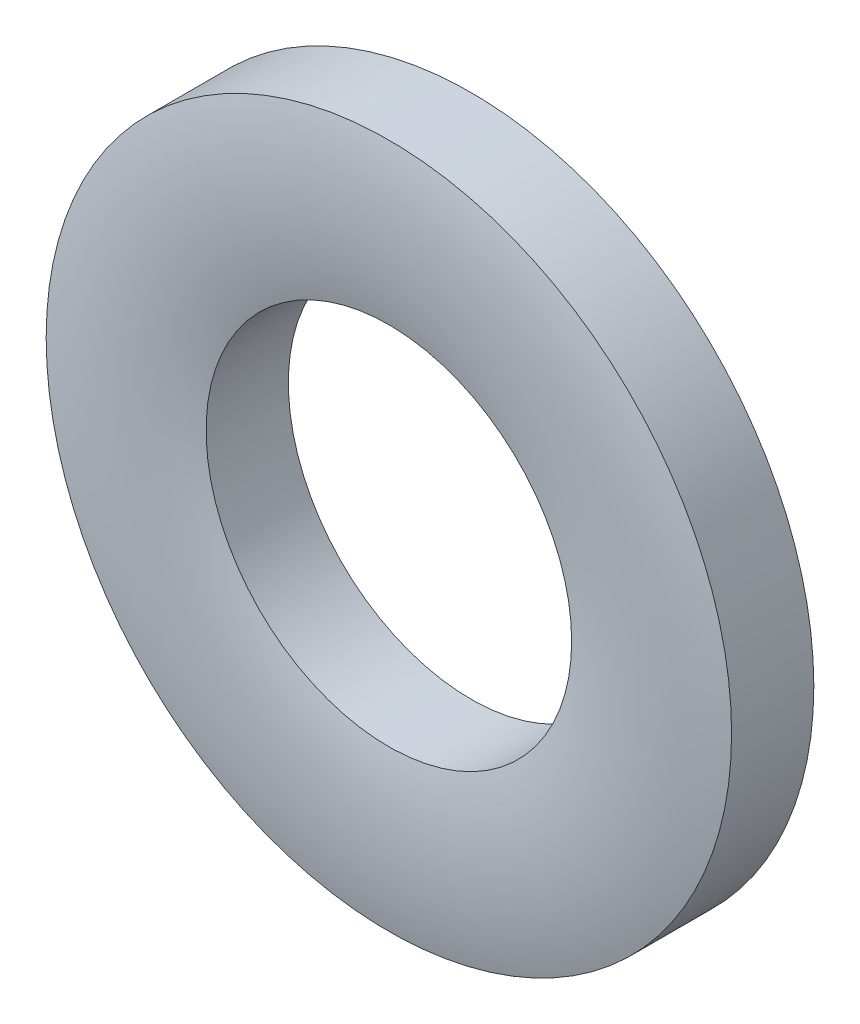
ISO-10303-21;
HEADER;
FILE_DESCRIPTION(('STEP AP214'),'2;1');
FILE_NAME('part.step','',(''),(''),'','','');
FILE_SCHEMA(('AUTOMOTIVE_DESIGN { 1 0 10303 214 1 1 1 1 }'));
ENDSEC;
DATA;
#1=APPLICATION_CONTEXT('core data for automotive mechanical design processes');
#2=APPLICATION_PROTOCOL_DEFINITION('international standard','automotive_design',2000,#1);
#3=PRODUCT_CONTEXT('',#1,'mechanical');
#4=PRODUCT('Part','Part','',(#3));
#5=PRODUCT_RELATED_PRODUCT_CATEGORY('part','',(#4));
#6=PRODUCT_DEFINITION_FORMATION('','',#4);
#7=PRODUCT_DEFINITION_CONTEXT('part definition',#1,'design');
#8=PRODUCT_DEFINITION('design','',#6,#7);
#9=PRODUCT_DEFINITION_SHAPE('','',#8);
#10=(LENGTH_UNIT() NAMED_UNIT(*) SI_UNIT(.MILLI.,.METRE.));
#11=(NAMED_UNIT(*) PLANE_ANGLE_UNIT() SI_UNIT($,.RADIAN.));
#12=(NAMED_UNIT(*) SI_UNIT($,.STERADIAN.) SOLID_ANGLE_UNIT());
#13=UNCERTAINTY_MEASURE_WITH_UNIT(LENGTH_MEASURE(1.E-05),#10,'distance_accuracy_value','');
#14=(GEOMETRIC_REPRESENTATION_CONTEXT(3) GLOBAL_UNCERTAINTY_ASSIGNED_CONTEXT((#13)) GLOBAL_UNIT_ASSIGNED_CONTEXT((#10,
#11,#12)) REPRESENTATION_CONTEXT('',''));
#15=CARTESIAN_POINT('',(0.,0.,0.));
#16=DIRECTION('',(0.,0.,1.));
#17=DIRECTION('',(1.,0.,0.));
#18=AXIS2_PLACEMENT_3D('',#15,#16,#17);
#19=CARTESIAN_POINT('',(0.,3.2,-0.8));
#20=DIRECTION('',(0.,0.,1.));
#21=DIRECTION('',(1.,0.,0.));
#22=AXIS2_PLACEMENT_3D('',#19,#20,#21);
#23=PLANE('',#22);
#24=CARTESIAN_POINT('',(0.,0.,-0.8));
#25=DIRECTION('',(0.,0.,1.));
#26=DIRECTION('',(1.,0.,0.));
#27=AXIS2_PLACEMENT_3D('',#24,#25,#26);
#28=CIRCLE('',#27,6.);
#29=CARTESIAN_POINT('',(6.,0.,-0.8));
#30=VERTEX_POINT('',#29);
#31=EDGE_CURVE('E58',#30,#30,#28,.T.);
#32=ORIENTED_EDGE('',*,*,#31,.F.);
#33=EDGE_LOOP('',(#32));
#34=FACE_BOUND('',#33,.T.);
#35=CARTESIAN_POINT('',(0.,0.,-0.8));
#36=DIRECTION('',(0.,0.,1.));
#37=DIRECTION('',(1.,0.,0.));
#38=AXIS2_PLACEMENT_3D('',#35,#36,#37);
#39=CIRCLE('',#38,3.2);
#40=CARTESIAN_POINT('',(3.2,0.,-0.8));
#41=VERTEX_POINT('',#40);
#42=EDGE_CURVE('E10',#41,#41,#39,.T.);
#43=ORIENTED_EDGE('',*,*,#42,.T.);
#44=EDGE_LOOP('',(#43));
#45=FACE_BOUND('',#44,.T.);
#46=ADVANCED_FACE('F39',(#34,#45),#23,.F.);
#47=CARTESIAN_POINT('',(0.,0.,0.8));
#48=DIRECTION('',(0.,0.,1.));
#49=DIRECTION('',(1.,0.,0.));
#50=AXIS2_PLACEMENT_3D('',#47,#48,#49);
#51=CYLINDRICAL_SURFACE('',#50,3.2);
#52=ORIENTED_EDGE('',*,*,#42,.F.);
#53=EDGE_LOOP('',(#52));
#54=FACE_BOUND('',#53,.T.);
#55=CARTESIAN_POINT('',(0.,0.,0.639999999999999));
#56=DIRECTION('',(0.,0.,1.));
#57=DIRECTION('',(1.,0.,0.));
#58=AXIS2_PLACEMENT_3D('',#55,#56,#57);
#59=CIRCLE('',#58,3.2);
#60=CARTESIAN_POINT('',(3.2,0.,0.639999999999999));
#61=VERTEX_POINT('',#60);
#62=EDGE_CURVE('E46',#61,#61,#59,.T.);
#63=ORIENTED_EDGE('',*,*,#62,.T.);
#64=EDGE_LOOP('',(#63));
#65=FACE_BOUND('',#64,.T.);
#66=ADVANCED_FACE('F69',(#54,#65),#51,.F.);
#67=CARTESIAN_POINT('',(0.,0.,-5.40500000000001));
#68=DIRECTION('',(0.,0.,1.));
#69=DIRECTION('',(1.,0.,0.));
#70=AXIS2_PLACEMENT_3D('',#67,#68,#69);
#71=DEGENERATE_TOROIDAL_SURFACE('',#70,4.6,6.20500000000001,.T.);
#72=ORIENTED_EDGE('',*,*,#62,.F.);
#73=EDGE_LOOP('',(#72));
#74=FACE_BOUND('',#73,.T.);
#75=CARTESIAN_POINT('',(0.,0.,0.64));
#76=DIRECTION('',(0.,0.,1.));
#77=DIRECTION('',(1.,0.,0.));
#78=AXIS2_PLACEMENT_3D('',#75,#76,#77);
#79=CIRCLE('',#78,6.);
#80=CARTESIAN_POINT('',(6.,0.,0.64));
#81=VERTEX_POINT('',#80);
#82=EDGE_CURVE('E52',#81,#81,#79,.T.);
#83=ORIENTED_EDGE('',*,*,#82,.T.);
#84=EDGE_LOOP('',(#83));
#85=FACE_BOUND('',#84,.T.);
#86=ADVANCED_FACE('F73',(#74,#85),#71,.T.);
#87=CARTESIAN_POINT('',(0.,0.,0.8));
#88=DIRECTION('',(0.,0.,1.));
#89=DIRECTION('',(1.,0.,0.));
#90=AXIS2_PLACEMENT_3D('',#87,#88,#89);
#91=CYLINDRICAL_SURFACE('',#90,6.);
#92=ORIENTED_EDGE('',*,*,#82,.F.);
#93=EDGE_LOOP('',(#92));
#94=FACE_BOUND('',#93,.T.);
#95=ORIENTED_EDGE('',*,*,#31,.T.);
#96=EDGE_LOOP('',(#95));
#97=FACE_BOUND('',#96,.T.);
#98=ADVANCED_FACE('F66',(#94,#97),#91,.T.);
#99=CLOSED_SHELL('',(#46,#66,#86,#98));
#100=MANIFOLD_SOLID_BREP('B2',#99);
#101=ADVANCED_BREP_SHAPE_REPRESENTATION('',(#18,#100),#14);
#102=SHAPE_DEFINITION_REPRESENTATION(#9,#101);
ENDSEC;
END-ISO-10303-21;
